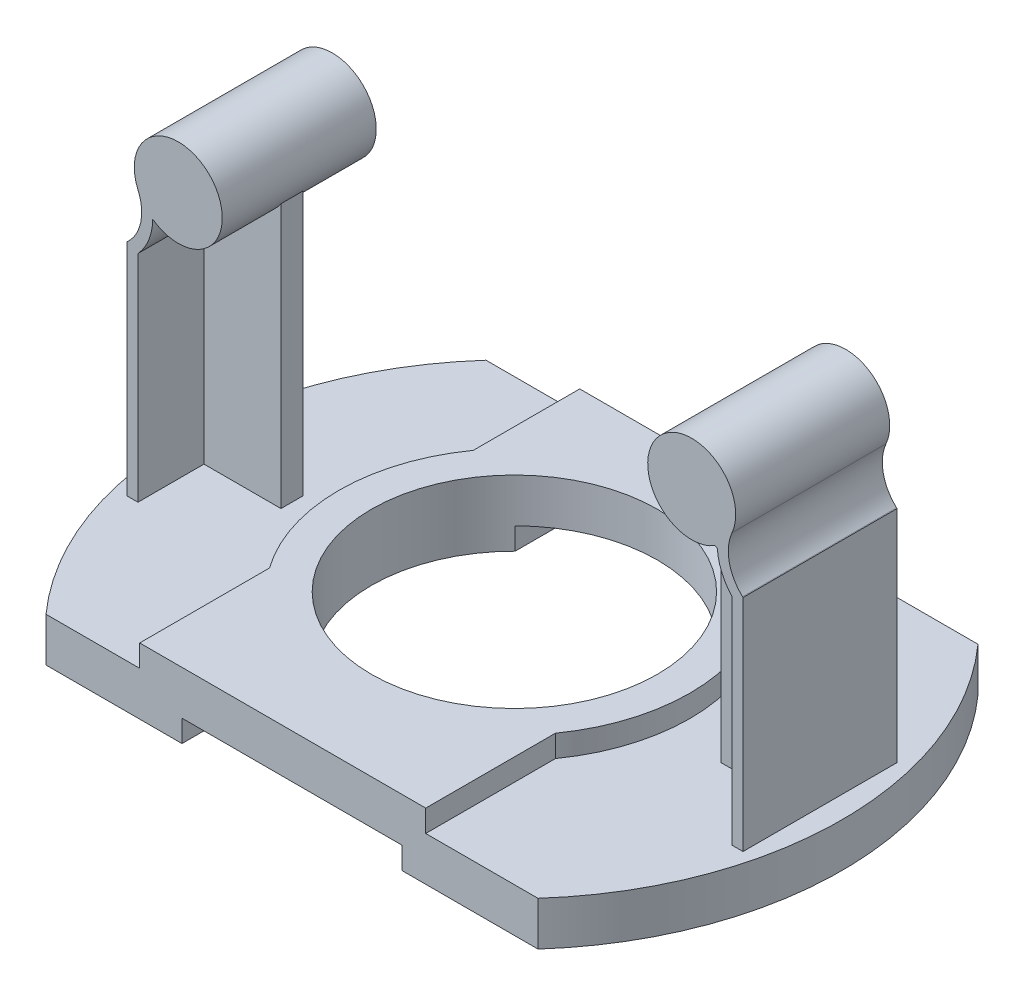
from build123d import *

# Parameters (mm, degrees)
BOSS_EXTRU_1_DEPTH      = 7
BOSS_EXTRU_1_2_DEPTH    = 7
CONG_1_R                = 2
ENL_V_START             = -3
ENL_V_MAT_EXTRU_2_DEPTH = 3
ENL_V_MAT_EXTRU_3_DEPTH = 3
CONG_3_R                = 2
ENL_V_MAT_EXTRU_4_DEPTH = 3
ENL_V_MAT_EXTRU_5_DEPTH = 3
BOSS_EXTRU_2_DEPTH      = 2
ESQUISSE9_W             = 10
ESQUISSE9_H             = 1.9545111
ENL_V_MAT_EXTRU_6_DEPTH = 30.207642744
ESQUISSE10_R            = 6.5
BOSS_EXTRU_3_DEPTH      = 1
ENL_V_START_2           = -21
ESQUISSE12_R            = 6.5
ENL_V_MAT_EXTRU_7_DEPTH = 21


with BuildPart() as part:
    # Esquisse1 → Boss.-Extru.1 (new body)
    with BuildSketch(Plane.XY):
        with BuildLine():
            Line((-14, 0), (-10, 0))
            Line((-10, 0), (-10, 12))
            ThreePointArc((-10, 12), (-12.183069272, 15.035243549), (-12.568474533, 11.316378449))
            Line((-12.568474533, 11.316378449), (-14, 10))
            Line((-14, 10), (-14, 0))
        make_face()
    extrude(amount=BOSS_EXTRU_1_DEPTH)

    # Cong_1
    cong_1_edges = [part.edges().sort_by_distance(p)[0] for p in [
        (-12.568474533, 11.316378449, 3.5),
    ]]
    fillet(cong_1_edges, radius=CONG_1_R)

    # Esquisse2 → Enl_v. mat.-Extru.2 (cut)
    with BuildSketch(Plane.XY.offset(7).offset(ENL_V_START)):
        with BuildLine():
            Line((-10, 12), (-10, 0))
            Line((-10, 0), (-13.5, 0))
            Line((-13.5, 0), (-13.5, 9.790884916))
            ThreePointArc((-13.5, 9.790884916), (-13.007457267, 10.57008181), (-12.830783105, 11.474809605))
            ThreePointArc((-12.830783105, 11.474809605), (-11.303829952, 11.136086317), (-10, 12))
        make_face()
    extrude(amount=ENL_V_MAT_EXTRU_2_DEPTH, mode=Mode.SUBTRACT)

    # Esquisse5 → Enl_v. mat.-Extru.3 (cut)
    with BuildSketch(Plane(origin=(0, 0, 0), x_dir=(-1, 0, 0), z_dir=(0, 0, -1))):
        with BuildLine():
            Line((13.5, 0), (13.5, 9.790884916))
            ThreePointArc((13.5, 9.790884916), (13.007457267, 10.57008181), (12.830783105, 11.474809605))
            ThreePointArc((12.830783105, 11.474809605), (11.303829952, 11.136086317), (10, 12))
            Line((10, 12), (10, 0))
            Line((10, 0), (13.5, 0))
        make_face()
    extrude(amount=-ENL_V_MAT_EXTRU_3_DEPTH, mode=Mode.SUBTRACT)



with BuildPart() as body_2:
    # Esquisse1 → Boss.-Extru.1 2 (new body)
    with BuildSketch(Plane.XY):
        with BuildLine():
            Line((10, 0), (10, 12))
            ThreePointArc((10, 12), (12.183069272, 15.035243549), (12.568474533, 11.316378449))
            Line((12.568474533, 11.316378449), (14, 10))
            Line((14, 10), (14, 0))
            Line((14, 0), (10, 0))
        make_face()
    extrude(amount=BOSS_EXTRU_1_2_DEPTH)

    # Cong_3
    cong_3_edges = [body_2.edges().sort_by_distance(p)[0] for p in [
        (12.568474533, 11.316378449, 3.5),
    ]]
    fillet(cong_3_edges, radius=CONG_3_R)

    # Esquisse6 → Enl_v. mat.-Extru.4 (cut)
    with BuildSketch(Plane.XY.offset(7).offset(ENL_V_START)):
        with BuildLine():
            Line((10, 0), (10, 12))
            ThreePointArc((10, 12), (11.220765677, 11.155424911), (12.68761618, 11.383296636))
            ThreePointArc((12.68761618, 11.383296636), (12.784657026, 11.385916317), (12.838196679, 11.304939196))
            ThreePointArc((12.838196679, 11.304939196), (13.040393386, 10.491654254), (13.5, 9.790884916))
            Line((13.5, 9.790884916), (13.5, 0))
            Line((13.5, 0), (10, 0))
        make_face()
        with BuildLine():
            Line((-13.5, 9.790884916), (-13.5, 0))
            Line((-13.5, 0), (-10, 0))
            Line((-10, 0), (-10, 12))
            ThreePointArc((-10, 12), (-11.303829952, 11.136086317), (-12.830783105, 11.474809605))
            ThreePointArc((-12.830783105, 11.474809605), (-13.007457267, 10.57008181), (-13.5, 9.790884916))
        make_face()
    extrude(amount=ENL_V_MAT_EXTRU_4_DEPTH, mode=Mode.SUBTRACT)

    # Esquisse7 → Enl_v. mat.-Extru.5 (cut)
    with BuildSketch(Plane(origin=(0, 0, 0), x_dir=(-1, 0, 0), z_dir=(0, 0, -1))):
        with BuildLine():
            Line((-10, 0), (-10, 12))
            ThreePointArc((-10, 12), (-11.220765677, 11.155424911), (-12.68761618, 11.383296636))
            ThreePointArc((-12.68761618, 11.383296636), (-12.784657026, 11.385916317), (-12.838196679, 11.304939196))
            ThreePointArc((-12.838196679, 11.304939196), (-13.040393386, 10.491654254), (-13.5, 9.790884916))
            Line((-13.5, 9.790884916), (-13.5, 0))
            Line((-13.5, 0), (-10, 0))
        make_face()
    extrude(amount=-ENL_V_MAT_EXTRU_5_DEPTH, mode=Mode.SUBTRACT)


with BuildPart() as part_1:
    add(part.part)

    add(body_2.part)  # Boss.-Extru.2 merges body 2
    # Esquisse8 → Boss.-Extru.2 (add)
    with BuildSketch(Plane.XZ):
        with BuildLine():
            Line((-11.180339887, -6.5), (11.180339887, -6.5))
            ThreePointArc((11.180339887, -6.5), (15, 3.5), (11.180339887, 13.5))
            Line((11.180339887, 13.5), (-11.180339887, 13.5))
            ThreePointArc((-11.180339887, 13.5), (-15, 3.5), (-11.180339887, -6.5))
        make_face()
    extrude(amount=BOSS_EXTRU_2_DEPTH)

    # Esquisse9 → Enl_v. mat.-Extru.6 (cut, through all)
    with BuildSketch(Plane.XY.offset(13.5)):
        with Locations((0, -1.97725555)):
            Rectangle(ESQUISSE9_W, ESQUISSE9_H)
    extrude(amount=-ENL_V_MAT_EXTRU_6_DEPTH, mode=Mode.SUBTRACT)

    # Esquisse10 → Boss.-Extru.3 (add)
    with BuildSketch(Plane(origin=(0, 0, 0), x_dir=(1, 0, 0), z_dir=(0, 1, 0))):
        with BuildLine():
            Line((-6.921622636, 6.5), (6.078377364, 6.5))
            Line((6.078377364, 6.5), (6.078377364, 1.661391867))
            ThreePointArc((6.078377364, 1.661391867), (7.559722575, -2.97022463), (6.078377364, -7.601841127))
            Line((6.078377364, -7.601841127), (6.078377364, -13.5))
            Line((6.078377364, -13.5), (-6.921622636, -13.5))
            Line((-6.921622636, -13.5), (-6.921622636, -7.601841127))
            ThreePointArc((-6.921622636, -7.601841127), (-8.402967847, -2.97022463), (-6.921622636, 1.661391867))
            Line((-6.921622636, 1.661391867), (-6.921622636, 6.5))
        make_face()
        with Locations(Location((-0.421622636, -2.97022463, 0), (0, 0, 270))):
            Circle(ESQUISSE10_R, mode=Mode.SUBTRACT)
    extrude(amount=BOSS_EXTRU_3_DEPTH)

    # Esquisse12 → Enl_v. mat.-Extru.7 (cut)
    with BuildSketch(Plane(origin=(0, 0, 0), x_dir=(1, 0, 0), z_dir=(0, 1, 0)).offset(ENL_V_START_2)):
        with Locations(Location((-0.421622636, -2.97022463, 0), (0, 0, 134.778326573))):
            Circle(ESQUISSE12_R)
    extrude(amount=ENL_V_MAT_EXTRU_7_DEPTH, mode=Mode.SUBTRACT)


solid = part_1.part
